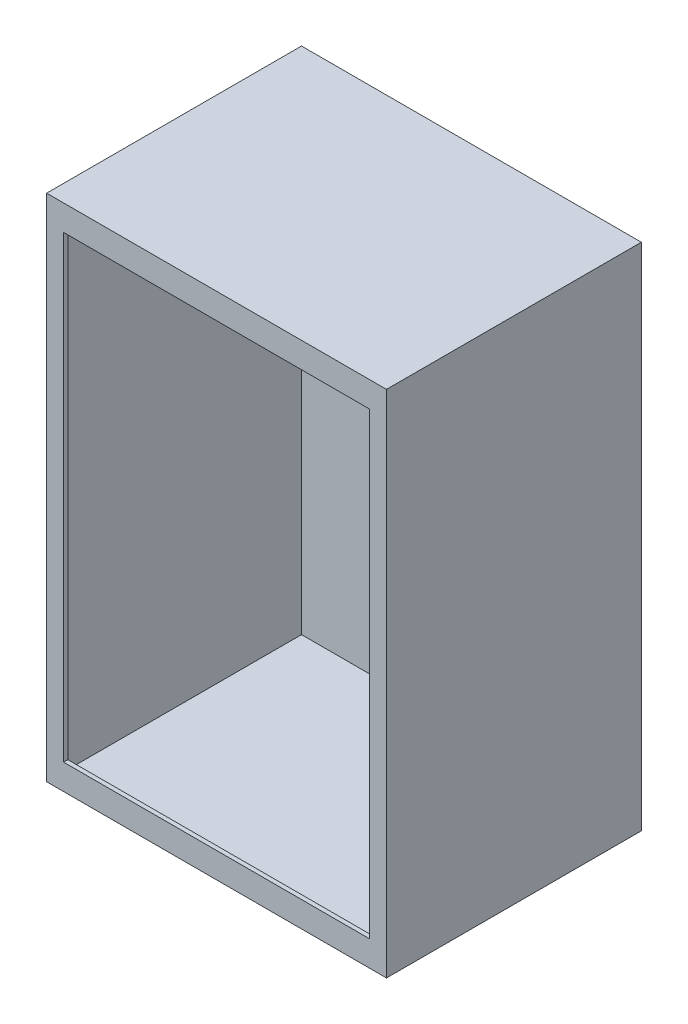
ISO-10303-21;
HEADER;
FILE_DESCRIPTION(('STEP AP214'),'2;1');
FILE_NAME('part.step','',(''),(''),'','','');
FILE_SCHEMA(('AUTOMOTIVE_DESIGN { 1 0 10303 214 1 1 1 1 }'));
ENDSEC;
DATA;
#1=APPLICATION_CONTEXT('core data for automotive mechanical design processes');
#2=APPLICATION_PROTOCOL_DEFINITION('international standard','automotive_design',2000,#1);
#3=PRODUCT_CONTEXT('',#1,'mechanical');
#4=PRODUCT('Part','Part','',(#3));
#5=PRODUCT_RELATED_PRODUCT_CATEGORY('part','',(#4));
#6=PRODUCT_DEFINITION_FORMATION('','',#4);
#7=PRODUCT_DEFINITION_CONTEXT('part definition',#1,'design');
#8=PRODUCT_DEFINITION('design','',#6,#7);
#9=PRODUCT_DEFINITION_SHAPE('','',#8);
#10=(LENGTH_UNIT() NAMED_UNIT(*) SI_UNIT(.MILLI.,.METRE.));
#11=(NAMED_UNIT(*) PLANE_ANGLE_UNIT() SI_UNIT($,.RADIAN.));
#12=(NAMED_UNIT(*) SI_UNIT($,.STERADIAN.) SOLID_ANGLE_UNIT());
#13=UNCERTAINTY_MEASURE_WITH_UNIT(LENGTH_MEASURE(1.E-05),#10,'distance_accuracy_value','');
#14=(GEOMETRIC_REPRESENTATION_CONTEXT(3) GLOBAL_UNCERTAINTY_ASSIGNED_CONTEXT((#13)) GLOBAL_UNIT_ASSIGNED_CONTEXT((#10,
#11,#12)) REPRESENTATION_CONTEXT('',''));
#15=CARTESIAN_POINT('',(0.,0.,0.));
#16=DIRECTION('',(0.,0.,1.));
#17=DIRECTION('',(1.,0.,0.));
#18=AXIS2_PLACEMENT_3D('',#15,#16,#17);
#19=CARTESIAN_POINT('',(0.,0.,300.));
#20=DIRECTION('',(1.,0.,0.));
#21=DIRECTION('',(0.,0.,-1.));
#22=AXIS2_PLACEMENT_3D('',#19,#20,#21);
#23=PLANE('',#22);
#24=DIRECTION('',(0.,-1.,0.));
#25=VECTOR('',#24,1.);
#26=CARTESIAN_POINT('',(0.,0.,0.));
#27=LINE('',#26,#25);
#28=CARTESIAN_POINT('',(0.,600.,0.));
#29=VERTEX_POINT('',#28);
#30=CARTESIAN_POINT('',(0.,0.,0.));
#31=VERTEX_POINT('',#30);
#32=EDGE_CURVE('E178',#29,#31,#27,.T.);
#33=ORIENTED_EDGE('',*,*,#32,.T.);
#34=DIRECTION('',(0.,0.,-1.));
#35=VECTOR('',#34,1.);
#36=CARTESIAN_POINT('',(0.,0.,300.));
#37=LINE('',#36,#35);
#38=CARTESIAN_POINT('',(0.,0.,300.));
#39=VERTEX_POINT('',#38);
#40=EDGE_CURVE('E157',#39,#31,#37,.T.);
#41=ORIENTED_EDGE('',*,*,#40,.F.);
#42=DIRECTION('',(0.,-1.,0.));
#43=VECTOR('',#42,1.);
#44=CARTESIAN_POINT('',(0.,0.,300.));
#45=LINE('',#44,#43);
#46=CARTESIAN_POINT('',(0.,600.,300.));
#47=VERTEX_POINT('',#46);
#48=EDGE_CURVE('E173',#47,#39,#45,.T.);
#49=ORIENTED_EDGE('',*,*,#48,.F.);
#50=DIRECTION('',(0.,0.,-1.));
#51=VECTOR('',#50,1.);
#52=CARTESIAN_POINT('',(0.,600.,300.));
#53=LINE('',#52,#51);
#54=EDGE_CURVE('E170',#47,#29,#53,.T.);
#55=ORIENTED_EDGE('',*,*,#54,.T.);
#56=EDGE_LOOP('',(#33,#41,#49,#55));
#57=FACE_BOUND('',#56,.T.);
#58=ADVANCED_FACE('F37',(#57),#23,.F.);
#59=CARTESIAN_POINT('',(0.,0.,300.));
#60=DIRECTION('',(0.,1.,0.));
#61=DIRECTION('',(0.,0.,1.));
#62=AXIS2_PLACEMENT_3D('',#59,#60,#61);
#63=PLANE('',#62);
#64=DIRECTION('',(1.,0.,0.));
#65=VECTOR('',#64,1.);
#66=CARTESIAN_POINT('',(0.,0.,0.));
#67=LINE('',#66,#65);
#68=CARTESIAN_POINT('',(400.,0.,0.));
#69=VERTEX_POINT('',#68);
#70=EDGE_CURVE('E176',#31,#69,#67,.T.);
#71=ORIENTED_EDGE('',*,*,#70,.T.);
#72=DIRECTION('',(0.,0.,-1.));
#73=VECTOR('',#72,1.);
#74=CARTESIAN_POINT('',(400.,0.,300.));
#75=LINE('',#74,#73);
#76=CARTESIAN_POINT('',(400.,0.,300.));
#77=VERTEX_POINT('',#76);
#78=EDGE_CURVE('E163',#77,#69,#75,.T.);
#79=ORIENTED_EDGE('',*,*,#78,.F.);
#80=DIRECTION('',(1.,0.,0.));
#81=VECTOR('',#80,1.);
#82=CARTESIAN_POINT('',(0.,0.,300.));
#83=LINE('',#82,#81);
#84=EDGE_CURVE('E90',#39,#77,#83,.T.);
#85=ORIENTED_EDGE('',*,*,#84,.F.);
#86=ORIENTED_EDGE('',*,*,#40,.T.);
#87=EDGE_LOOP('',(#71,#79,#85,#86));
#88=FACE_BOUND('',#87,.T.);
#89=ADVANCED_FACE('F264',(#88),#63,.F.);
#90=CARTESIAN_POINT('',(400.,0.,300.));
#91=DIRECTION('',(-1.,0.,0.));
#92=DIRECTION('',(0.,0.,1.));
#93=AXIS2_PLACEMENT_3D('',#90,#91,#92);
#94=PLANE('',#93);
#95=DIRECTION('',(0.,1.,0.));
#96=VECTOR('',#95,1.);
#97=CARTESIAN_POINT('',(400.,0.,0.));
#98=LINE('',#97,#96);
#99=CARTESIAN_POINT('',(400.,600.,0.));
#100=VERTEX_POINT('',#99);
#101=EDGE_CURVE('E174',#69,#100,#98,.T.);
#102=ORIENTED_EDGE('',*,*,#101,.T.);
#103=DIRECTION('',(0.,0.,-1.));
#104=VECTOR('',#103,1.);
#105=CARTESIAN_POINT('',(400.,600.,300.));
#106=LINE('',#105,#104);
#107=CARTESIAN_POINT('',(400.,600.,300.));
#108=VERTEX_POINT('',#107);
#109=EDGE_CURVE('E168',#108,#100,#106,.T.);
#110=ORIENTED_EDGE('',*,*,#109,.F.);
#111=DIRECTION('',(0.,1.,0.));
#112=VECTOR('',#111,1.);
#113=CARTESIAN_POINT('',(400.,0.,300.));
#114=LINE('',#113,#112);
#115=EDGE_CURVE('E182',#77,#108,#114,.T.);
#116=ORIENTED_EDGE('',*,*,#115,.F.);
#117=ORIENTED_EDGE('',*,*,#78,.T.);
#118=EDGE_LOOP('',(#102,#110,#116,#117));
#119=FACE_BOUND('',#118,.T.);
#120=ADVANCED_FACE('F269',(#119),#94,.F.);
#121=CARTESIAN_POINT('',(0.,600.,300.));
#122=DIRECTION('',(0.,-1.,0.));
#123=DIRECTION('',(0.,0.,-1.));
#124=AXIS2_PLACEMENT_3D('',#121,#122,#123);
#125=PLANE('',#124);
#126=DIRECTION('',(-1.,0.,0.));
#127=VECTOR('',#126,1.);
#128=CARTESIAN_POINT('',(0.,600.,0.));
#129=LINE('',#128,#127);
#130=EDGE_CURVE('E82',#100,#29,#129,.T.);
#131=ORIENTED_EDGE('',*,*,#130,.T.);
#132=ORIENTED_EDGE('',*,*,#54,.F.);
#133=DIRECTION('',(-1.,0.,0.));
#134=VECTOR('',#133,1.);
#135=CARTESIAN_POINT('',(0.,600.,300.));
#136=LINE('',#135,#134);
#137=EDGE_CURVE('E61',#108,#47,#136,.T.);
#138=ORIENTED_EDGE('',*,*,#137,.F.);
#139=ORIENTED_EDGE('',*,*,#109,.T.);
#140=EDGE_LOOP('',(#131,#132,#138,#139));
#141=FACE_BOUND('',#140,.T.);
#142=ADVANCED_FACE('F280',(#141),#125,.F.);
#143=CARTESIAN_POINT('',(0.,0.,300.));
#144=DIRECTION('',(0.,0.,-1.));
#145=DIRECTION('',(-1.,0.,0.));
#146=AXIS2_PLACEMENT_3D('',#143,#144,#145);
#147=PLANE('',#146);
#148=DIRECTION('',(-1.,0.,0.));
#149=VECTOR('',#148,1.);
#150=CARTESIAN_POINT('',(0.,30.,300.));
#151=LINE('',#150,#149);
#152=CARTESIAN_POINT('',(380.,30.,300.));
#153=VERTEX_POINT('',#152);
#154=CARTESIAN_POINT('',(19.9999999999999,30.,300.));
#155=VERTEX_POINT('',#154);
#156=EDGE_CURVE('E153',#153,#155,#151,.T.);
#157=ORIENTED_EDGE('',*,*,#156,.T.);
#158=DIRECTION('',(0.,1.,0.));
#159=VECTOR('',#158,1.);
#160=CARTESIAN_POINT('',(19.9999999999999,0.,300.));
#161=LINE('',#160,#159);
#162=CARTESIAN_POINT('',(20.,570.,300.));
#163=VERTEX_POINT('',#162);
#164=EDGE_CURVE('E11',#155,#163,#161,.T.);
#165=ORIENTED_EDGE('',*,*,#164,.T.);
#166=DIRECTION('',(1.,0.,0.));
#167=VECTOR('',#166,1.);
#168=CARTESIAN_POINT('',(0.,570.,300.));
#169=LINE('',#168,#167);
#170=CARTESIAN_POINT('',(380.,570.,300.));
#171=VERTEX_POINT('',#170);
#172=EDGE_CURVE('E45',#163,#171,#169,.T.);
#173=ORIENTED_EDGE('',*,*,#172,.T.);
#174=DIRECTION('',(0.,-1.,0.));
#175=VECTOR('',#174,1.);
#176=CARTESIAN_POINT('',(380.,0.,300.));
#177=LINE('',#176,#175);
#178=EDGE_CURVE('E141',#171,#153,#177,.T.);
#179=ORIENTED_EDGE('',*,*,#178,.T.);
#180=EDGE_LOOP('',(#157,#165,#173,#179));
#181=FACE_BOUND('',#180,.T.);
#182=ORIENTED_EDGE('',*,*,#48,.T.);
#183=ORIENTED_EDGE('',*,*,#84,.T.);
#184=ORIENTED_EDGE('',*,*,#115,.T.);
#185=ORIENTED_EDGE('',*,*,#137,.T.);
#186=EDGE_LOOP('',(#182,#183,#184,#185));
#187=FACE_BOUND('',#186,.T.);
#188=ADVANCED_FACE('F152',(#181,#187),#147,.F.);
#189=CARTESIAN_POINT('',(0.,0.,0.));
#190=DIRECTION('',(0.,0.,-1.));
#191=DIRECTION('',(-1.,0.,0.));
#192=AXIS2_PLACEMENT_3D('',#189,#190,#191);
#193=PLANE('',#192);
#194=ORIENTED_EDGE('',*,*,#32,.F.);
#195=ORIENTED_EDGE('',*,*,#130,.F.);
#196=ORIENTED_EDGE('',*,*,#101,.F.);
#197=ORIENTED_EDGE('',*,*,#70,.F.);
#198=EDGE_LOOP('',(#194,#195,#196,#197));
#199=FACE_BOUND('',#198,.T.);
#200=ADVANCED_FACE('F274',(#199),#193,.T.);
#201=CARTESIAN_POINT('',(0.,570.,300.));
#202=DIRECTION('',(0.,1.,0.));
#203=DIRECTION('',(1.,0.,0.));
#204=AXIS2_PLACEMENT_3D('',#201,#202,#203);
#205=PLANE('',#204);
#206=ORIENTED_EDGE('',*,*,#172,.F.);
#207=DIRECTION('',(0.,0.,-1.));
#208=VECTOR('',#207,1.);
#209=CARTESIAN_POINT('',(20.,570.,300.));
#210=LINE('',#209,#208);
#211=CARTESIAN_POINT('',(20.,570.,295.));
#212=VERTEX_POINT('',#211);
#213=EDGE_CURVE('E136',#212,#163,#210,.F.);
#214=ORIENTED_EDGE('',*,*,#213,.F.);
#215=DIRECTION('',(1.,0.,0.));
#216=VECTOR('',#215,1.);
#217=CARTESIAN_POINT('',(0.,570.,295.));
#218=LINE('',#217,#216);
#219=CARTESIAN_POINT('',(380.,570.,295.));
#220=VERTEX_POINT('',#219);
#221=EDGE_CURVE('E149',#212,#220,#218,.T.);
#222=ORIENTED_EDGE('',*,*,#221,.T.);
#223=DIRECTION('',(0.,0.,-1.));
#224=VECTOR('',#223,1.);
#225=CARTESIAN_POINT('',(380.,570.,300.));
#226=LINE('',#225,#224);
#227=EDGE_CURVE('E52',#220,#171,#226,.F.);
#228=ORIENTED_EDGE('',*,*,#227,.T.);
#229=EDGE_LOOP('',(#206,#214,#222,#228));
#230=FACE_BOUND('',#229,.T.);
#231=ADVANCED_FACE('F135',(#230),#205,.F.);
#232=CARTESIAN_POINT('',(380.,0.,300.));
#233=DIRECTION('',(1.,0.,0.));
#234=DIRECTION('',(0.,-1.,0.));
#235=AXIS2_PLACEMENT_3D('',#232,#233,#234);
#236=PLANE('',#235);
#237=ORIENTED_EDGE('',*,*,#178,.F.);
#238=ORIENTED_EDGE('',*,*,#227,.F.);
#239=DIRECTION('',(0.,-1.,0.));
#240=VECTOR('',#239,1.);
#241=CARTESIAN_POINT('',(380.,0.,295.));
#242=LINE('',#241,#240);
#243=CARTESIAN_POINT('',(380.,30.,295.));
#244=VERTEX_POINT('',#243);
#245=EDGE_CURVE('E196',#220,#244,#242,.T.);
#246=ORIENTED_EDGE('',*,*,#245,.T.);
#247=DIRECTION('',(0.,0.,-1.));
#248=VECTOR('',#247,1.);
#249=CARTESIAN_POINT('',(380.,30.,300.));
#250=LINE('',#249,#248);
#251=EDGE_CURVE('E186',#244,#153,#250,.F.);
#252=ORIENTED_EDGE('',*,*,#251,.T.);
#253=EDGE_LOOP('',(#237,#238,#246,#252));
#254=FACE_BOUND('',#253,.T.);
#255=ADVANCED_FACE('F318',(#254),#236,.F.);
#256=CARTESIAN_POINT('',(0.,30.,300.));
#257=DIRECTION('',(0.,-1.,0.));
#258=DIRECTION('',(-1.,0.,0.));
#259=AXIS2_PLACEMENT_3D('',#256,#257,#258);
#260=PLANE('',#259);
#261=ORIENTED_EDGE('',*,*,#156,.F.);
#262=ORIENTED_EDGE('',*,*,#251,.F.);
#263=DIRECTION('',(-1.,0.,0.));
#264=VECTOR('',#263,1.);
#265=CARTESIAN_POINT('',(0.,30.,295.));
#266=LINE('',#265,#264);
#267=CARTESIAN_POINT('',(19.9999999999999,30.,295.));
#268=VERTEX_POINT('',#267);
#269=EDGE_CURVE('E192',#244,#268,#266,.T.);
#270=ORIENTED_EDGE('',*,*,#269,.T.);
#271=DIRECTION('',(0.,0.,-1.));
#272=VECTOR('',#271,1.);
#273=CARTESIAN_POINT('',(19.9999999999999,30.,300.));
#274=LINE('',#273,#272);
#275=EDGE_CURVE('E148',#268,#155,#274,.F.);
#276=ORIENTED_EDGE('',*,*,#275,.T.);
#277=EDGE_LOOP('',(#261,#262,#270,#276));
#278=FACE_BOUND('',#277,.T.);
#279=ADVANCED_FACE('F328',(#278),#260,.F.);
#280=CARTESIAN_POINT('',(19.9999999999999,0.,300.));
#281=DIRECTION('',(-1.,0.,0.));
#282=DIRECTION('',(0.,1.,0.));
#283=AXIS2_PLACEMENT_3D('',#280,#281,#282);
#284=PLANE('',#283);
#285=ORIENTED_EDGE('',*,*,#164,.F.);
#286=ORIENTED_EDGE('',*,*,#275,.F.);
#287=DIRECTION('',(0.,1.,0.));
#288=VECTOR('',#287,1.);
#289=CARTESIAN_POINT('',(19.9999999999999,0.,295.));
#290=LINE('',#289,#288);
#291=EDGE_CURVE('E147',#268,#212,#290,.T.);
#292=ORIENTED_EDGE('',*,*,#291,.T.);
#293=ORIENTED_EDGE('',*,*,#213,.T.);
#294=EDGE_LOOP('',(#285,#286,#292,#293));
#295=FACE_BOUND('',#294,.T.);
#296=ADVANCED_FACE('F144',(#295),#284,.F.);
#297=CARTESIAN_POINT('',(3.,0.,300.));
#298=DIRECTION('',(1.,0.,0.));
#299=DIRECTION('',(0.,0.,-1.));
#300=AXIS2_PLACEMENT_3D('',#297,#298,#299);
#301=PLANE('',#300);
#302=DIRECTION('',(0.,-1.,0.));
#303=VECTOR('',#302,1.);
#304=CARTESIAN_POINT('',(3.,0.,3.));
#305=LINE('',#304,#303);
#306=CARTESIAN_POINT('',(3.,597.,3.));
#307=VERTEX_POINT('',#306);
#308=CARTESIAN_POINT('',(3.,3.,3.));
#309=VERTEX_POINT('',#308);
#310=EDGE_CURVE('E223',#307,#309,#305,.T.);
#311=ORIENTED_EDGE('',*,*,#310,.F.);
#312=DIRECTION('',(0.,0.,-1.));
#313=VECTOR('',#312,1.);
#314=CARTESIAN_POINT('',(3.,597.,300.));
#315=LINE('',#314,#313);
#316=CARTESIAN_POINT('',(3.,597.,295.));
#317=VERTEX_POINT('',#316);
#318=EDGE_CURVE('E205',#317,#307,#315,.T.);
#319=ORIENTED_EDGE('',*,*,#318,.F.);
#320=DIRECTION('',(0.,-1.,0.));
#321=VECTOR('',#320,1.);
#322=CARTESIAN_POINT('',(3.,0.,295.));
#323=LINE('',#322,#321);
#324=CARTESIAN_POINT('',(3.,3.,295.));
#325=VERTEX_POINT('',#324);
#326=EDGE_CURVE('E209',#317,#325,#323,.T.);
#327=ORIENTED_EDGE('',*,*,#326,.T.);
#328=DIRECTION('',(0.,0.,-1.));
#329=VECTOR('',#328,1.);
#330=CARTESIAN_POINT('',(3.,3.,300.));
#331=LINE('',#330,#329);
#332=EDGE_CURVE('E193',#325,#309,#331,.T.);
#333=ORIENTED_EDGE('',*,*,#332,.T.);
#334=EDGE_LOOP('',(#311,#319,#327,#333));
#335=FACE_BOUND('',#334,.T.);
#336=ADVANCED_FACE('F237',(#335),#301,.T.);
#337=CARTESIAN_POINT('',(0.,3.,300.));
#338=DIRECTION('',(0.,1.,0.));
#339=DIRECTION('',(0.,0.,1.));
#340=AXIS2_PLACEMENT_3D('',#337,#338,#339);
#341=PLANE('',#340);
#342=DIRECTION('',(1.,0.,0.));
#343=VECTOR('',#342,1.);
#344=CARTESIAN_POINT('',(0.,3.,3.));
#345=LINE('',#344,#343);
#346=CARTESIAN_POINT('',(397.,3.,3.));
#347=VERTEX_POINT('',#346);
#348=EDGE_CURVE('E218',#309,#347,#345,.T.);
#349=ORIENTED_EDGE('',*,*,#348,.F.);
#350=ORIENTED_EDGE('',*,*,#332,.F.);
#351=DIRECTION('',(1.,0.,0.));
#352=VECTOR('',#351,1.);
#353=CARTESIAN_POINT('',(0.,3.,295.));
#354=LINE('',#353,#352);
#355=CARTESIAN_POINT('',(397.,3.,295.));
#356=VERTEX_POINT('',#355);
#357=EDGE_CURVE('E212',#325,#356,#354,.T.);
#358=ORIENTED_EDGE('',*,*,#357,.T.);
#359=DIRECTION('',(0.,0.,-1.));
#360=VECTOR('',#359,1.);
#361=CARTESIAN_POINT('',(397.,3.,300.));
#362=LINE('',#361,#360);
#363=EDGE_CURVE('E216',#356,#347,#362,.T.);
#364=ORIENTED_EDGE('',*,*,#363,.T.);
#365=EDGE_LOOP('',(#349,#350,#358,#364));
#366=FACE_BOUND('',#365,.T.);
#367=ADVANCED_FACE('F241',(#366),#341,.T.);
#368=CARTESIAN_POINT('',(397.,0.,300.));
#369=DIRECTION('',(-1.,0.,0.));
#370=DIRECTION('',(0.,0.,1.));
#371=AXIS2_PLACEMENT_3D('',#368,#369,#370);
#372=PLANE('',#371);
#373=DIRECTION('',(0.,1.,0.));
#374=VECTOR('',#373,1.);
#375=CARTESIAN_POINT('',(397.,0.,3.));
#376=LINE('',#375,#374);
#377=CARTESIAN_POINT('',(397.,597.,3.));
#378=VERTEX_POINT('',#377);
#379=EDGE_CURVE('E210',#347,#378,#376,.T.);
#380=ORIENTED_EDGE('',*,*,#379,.F.);
#381=ORIENTED_EDGE('',*,*,#363,.F.);
#382=DIRECTION('',(0.,1.,0.));
#383=VECTOR('',#382,1.);
#384=CARTESIAN_POINT('',(397.,0.,295.));
#385=LINE('',#384,#383);
#386=CARTESIAN_POINT('',(397.,597.,295.));
#387=VERTEX_POINT('',#386);
#388=EDGE_CURVE('E206',#356,#387,#385,.T.);
#389=ORIENTED_EDGE('',*,*,#388,.T.);
#390=DIRECTION('',(0.,0.,-1.));
#391=VECTOR('',#390,1.);
#392=CARTESIAN_POINT('',(397.,597.,300.));
#393=LINE('',#392,#391);
#394=EDGE_CURVE('E213',#387,#378,#393,.T.);
#395=ORIENTED_EDGE('',*,*,#394,.T.);
#396=EDGE_LOOP('',(#380,#381,#389,#395));
#397=FACE_BOUND('',#396,.T.);
#398=ADVANCED_FACE('F246',(#397),#372,.T.);
#399=CARTESIAN_POINT('',(0.,597.,300.));
#400=DIRECTION('',(0.,-1.,0.));
#401=DIRECTION('',(0.,0.,-1.));
#402=AXIS2_PLACEMENT_3D('',#399,#400,#401);
#403=PLANE('',#402);
#404=DIRECTION('',(-1.,0.,0.));
#405=VECTOR('',#404,1.);
#406=CARTESIAN_POINT('',(0.,597.,3.));
#407=LINE('',#406,#405);
#408=EDGE_CURVE('E207',#378,#307,#407,.T.);
#409=ORIENTED_EDGE('',*,*,#408,.F.);
#410=ORIENTED_EDGE('',*,*,#394,.F.);
#411=DIRECTION('',(-1.,0.,0.));
#412=VECTOR('',#411,1.);
#413=CARTESIAN_POINT('',(0.,597.,295.));
#414=LINE('',#413,#412);
#415=EDGE_CURVE('E203',#387,#317,#414,.T.);
#416=ORIENTED_EDGE('',*,*,#415,.T.);
#417=ORIENTED_EDGE('',*,*,#318,.T.);
#418=EDGE_LOOP('',(#409,#410,#416,#417));
#419=FACE_BOUND('',#418,.T.);
#420=ADVANCED_FACE('F250',(#419),#403,.T.);
#421=CARTESIAN_POINT('',(0.,0.,295.));
#422=DIRECTION('',(0.,0.,-1.));
#423=DIRECTION('',(-1.,0.,0.));
#424=AXIS2_PLACEMENT_3D('',#421,#422,#423);
#425=PLANE('',#424);
#426=ORIENTED_EDGE('',*,*,#269,.F.);
#427=ORIENTED_EDGE('',*,*,#245,.F.);
#428=ORIENTED_EDGE('',*,*,#221,.F.);
#429=ORIENTED_EDGE('',*,*,#291,.F.);
#430=EDGE_LOOP('',(#426,#427,#428,#429));
#431=FACE_BOUND('',#430,.T.);
#432=ORIENTED_EDGE('',*,*,#326,.F.);
#433=ORIENTED_EDGE('',*,*,#415,.F.);
#434=ORIENTED_EDGE('',*,*,#388,.F.);
#435=ORIENTED_EDGE('',*,*,#357,.F.);
#436=EDGE_LOOP('',(#432,#433,#434,#435));
#437=FACE_BOUND('',#436,.T.);
#438=ADVANCED_FACE('F252',(#431,#437),#425,.T.);
#439=CARTESIAN_POINT('',(0.,0.,3.));
#440=DIRECTION('',(0.,0.,-1.));
#441=DIRECTION('',(-1.,0.,0.));
#442=AXIS2_PLACEMENT_3D('',#439,#440,#441);
#443=PLANE('',#442);
#444=ORIENTED_EDGE('',*,*,#310,.T.);
#445=ORIENTED_EDGE('',*,*,#348,.T.);
#446=ORIENTED_EDGE('',*,*,#379,.T.);
#447=ORIENTED_EDGE('',*,*,#408,.T.);
#448=EDGE_LOOP('',(#444,#445,#446,#447));
#449=FACE_BOUND('',#448,.T.);
#450=ADVANCED_FACE('F233',(#449),#443,.F.);
#451=CLOSED_SHELL('',(#58,#89,#120,#142,#188,#200,#231,#255,#279,#296,#336,#367,#398,#420,#438,#450));
#452=MANIFOLD_SOLID_BREP('B2',#451);
#453=ADVANCED_BREP_SHAPE_REPRESENTATION('',(#18,#452),#14);
#454=SHAPE_DEFINITION_REPRESENTATION(#9,#453);
ENDSEC;
END-ISO-10303-21;
